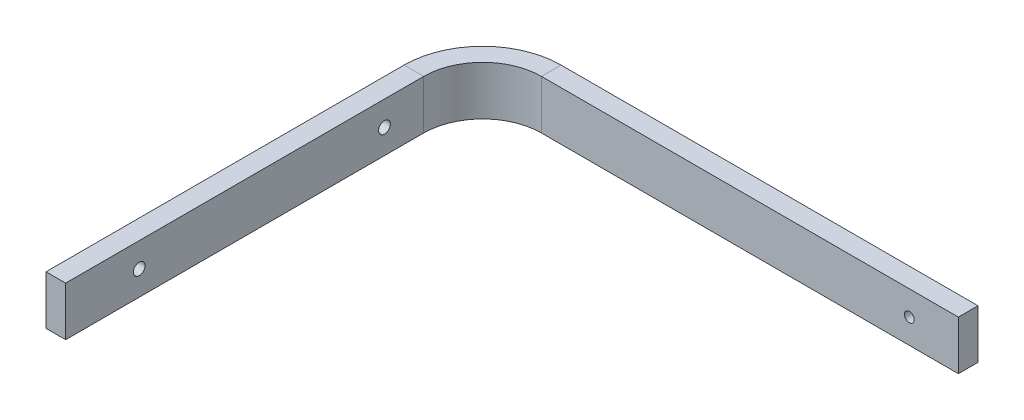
ISO-10303-21;
HEADER;
FILE_DESCRIPTION(('STEP AP214'),'2;1');
FILE_NAME('part.step','',(''),(''),'','','');
FILE_SCHEMA(('AUTOMOTIVE_DESIGN { 1 0 10303 214 1 1 1 1 }'));
ENDSEC;
DATA;
#1=APPLICATION_CONTEXT('core data for automotive mechanical design processes');
#2=APPLICATION_PROTOCOL_DEFINITION('international standard','automotive_design',2000,#1);
#3=PRODUCT_CONTEXT('',#1,'mechanical');
#4=PRODUCT('Part','Part','',(#3));
#5=PRODUCT_RELATED_PRODUCT_CATEGORY('part','',(#4));
#6=PRODUCT_DEFINITION_FORMATION('','',#4);
#7=PRODUCT_DEFINITION_CONTEXT('part definition',#1,'design');
#8=PRODUCT_DEFINITION('design','',#6,#7);
#9=PRODUCT_DEFINITION_SHAPE('','',#8);
#10=(LENGTH_UNIT() NAMED_UNIT(*) SI_UNIT(.MILLI.,.METRE.));
#11=(NAMED_UNIT(*) PLANE_ANGLE_UNIT() SI_UNIT($,.RADIAN.));
#12=(NAMED_UNIT(*) SI_UNIT($,.STERADIAN.) SOLID_ANGLE_UNIT());
#13=UNCERTAINTY_MEASURE_WITH_UNIT(LENGTH_MEASURE(1.E-05),#10,'distance_accuracy_value','');
#14=(GEOMETRIC_REPRESENTATION_CONTEXT(3) GLOBAL_UNCERTAINTY_ASSIGNED_CONTEXT((#13)) GLOBAL_UNIT_ASSIGNED_CONTEXT((#10,
#11,#12)) REPRESENTATION_CONTEXT('',''));
#15=CARTESIAN_POINT('',(0.,0.,0.));
#16=DIRECTION('',(0.,0.,1.));
#17=DIRECTION('',(1.,0.,0.));
#18=AXIS2_PLACEMENT_3D('',#15,#16,#17);
#19=CARTESIAN_POINT('',(-252.51106428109,-12.4999999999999,-227.488935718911));
#20=DIRECTION('',(-1.,0.,0.));
#21=DIRECTION('',(0.,0.,1.));
#22=AXIS2_PLACEMENT_3D('',#19,#20,#21);
#23=PLANE('',#22);
#24=CARTESIAN_POINT('',(-252.511064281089,0.,185.000000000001));
#25=DIRECTION('',(1.,0.,0.));
#26=DIRECTION('',(0.,0.,-1.));
#27=AXIS2_PLACEMENT_3D('',#24,#25,#26);
#28=CIRCLE('',#27,2.99999999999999);
#29=CARTESIAN_POINT('',(-252.511064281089,0.,182.000000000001));
#30=VERTEX_POINT('',#29);
#31=EDGE_CURVE('E189',#30,#30,#28,.T.);
#32=ORIENTED_EDGE('',*,*,#31,.T.);
#33=EDGE_LOOP('',(#32));
#34=FACE_BOUND('',#33,.T.);
#35=DIRECTION('',(0.,0.,1.));
#36=VECTOR('',#35,1.);
#37=CARTESIAN_POINT('',(-252.51106428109,12.4999999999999,-227.488935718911));
#38=LINE('',#37,#36);
#39=CARTESIAN_POINT('',(-252.511064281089,12.5,40.0000000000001));
#40=VERTEX_POINT('',#39);
#41=CARTESIAN_POINT('',(-252.511064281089,12.5,222.511064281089));
#42=VERTEX_POINT('',#41);
#43=EDGE_CURVE('E162',#40,#42,#38,.T.);
#44=ORIENTED_EDGE('',*,*,#43,.F.);
#45=DIRECTION('',(0.,-1.,0.));
#46=VECTOR('',#45,1.);
#47=CARTESIAN_POINT('',(-252.511064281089,-12.4999999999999,40.0000000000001));
#48=LINE('',#47,#46);
#49=CARTESIAN_POINT('',(-252.511064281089,-12.5,40.0000000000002));
#50=VERTEX_POINT('',#49);
#51=EDGE_CURVE('E11',#40,#50,#48,.T.);
#52=ORIENTED_EDGE('',*,*,#51,.T.);
#53=DIRECTION('',(0.,0.,-1.));
#54=VECTOR('',#53,1.);
#55=CARTESIAN_POINT('',(-252.51106428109,-12.4999999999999,-227.488935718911));
#56=LINE('',#55,#54);
#57=CARTESIAN_POINT('',(-252.511064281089,-12.5,222.511064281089));
#58=VERTEX_POINT('',#57);
#59=EDGE_CURVE('E161',#58,#50,#56,.T.);
#60=ORIENTED_EDGE('',*,*,#59,.F.);
#61=DIRECTION('',(0.,-1.,0.));
#62=VECTOR('',#61,1.);
#63=CARTESIAN_POINT('',(-252.511064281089,12.5,222.511064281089));
#64=LINE('',#63,#62);
#65=EDGE_CURVE('E159',#42,#58,#64,.T.);
#66=ORIENTED_EDGE('',*,*,#65,.F.);
#67=EDGE_LOOP('',(#44,#52,#60,#66));
#68=FACE_BOUND('',#67,.T.);
#69=CARTESIAN_POINT('',(-252.51106428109,0.,60.0000000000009));
#70=DIRECTION('',(1.,0.,0.));
#71=DIRECTION('',(0.,0.,-1.));
#72=AXIS2_PLACEMENT_3D('',#69,#70,#71);
#73=CIRCLE('',#72,3.00000000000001);
#74=CARTESIAN_POINT('',(-252.51106428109,0.,57.0000000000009));
#75=VERTEX_POINT('',#74);
#76=EDGE_CURVE('E195',#75,#75,#73,.T.);
#77=ORIENTED_EDGE('',*,*,#76,.T.);
#78=EDGE_LOOP('',(#77));
#79=FACE_BOUND('',#78,.T.);
#80=ADVANCED_FACE('F33',(#34,#68,#79),#23,.T.);
#81=CARTESIAN_POINT('',(-242.51106428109,-12.4999999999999,-227.488935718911));
#82=DIRECTION('',(-1.,0.,0.));
#83=DIRECTION('',(0.,0.,1.));
#84=AXIS2_PLACEMENT_3D('',#81,#82,#83);
#85=PLANE('',#84);
#86=CARTESIAN_POINT('',(-242.511064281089,0.,185.000000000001));
#87=DIRECTION('',(1.,0.,0.));
#88=DIRECTION('',(0.,0.,-1.));
#89=AXIS2_PLACEMENT_3D('',#86,#87,#88);
#90=CIRCLE('',#89,2.99999999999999);
#91=CARTESIAN_POINT('',(-242.511064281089,0.,182.000000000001));
#92=VERTEX_POINT('',#91);
#93=EDGE_CURVE('E185',#92,#92,#90,.T.);
#94=ORIENTED_EDGE('',*,*,#93,.F.);
#95=EDGE_LOOP('',(#94));
#96=FACE_BOUND('',#95,.T.);
#97=DIRECTION('',(0.,-1.,0.));
#98=VECTOR('',#97,1.);
#99=CARTESIAN_POINT('',(-242.511064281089,-12.4999999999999,40.0000000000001));
#100=LINE('',#99,#98);
#101=CARTESIAN_POINT('',(-242.511064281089,12.5,40.0000000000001));
#102=VERTEX_POINT('',#101);
#103=CARTESIAN_POINT('',(-242.511064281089,-12.5,40.0000000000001));
#104=VERTEX_POINT('',#103);
#105=EDGE_CURVE('E42',#102,#104,#100,.T.);
#106=ORIENTED_EDGE('',*,*,#105,.F.);
#107=DIRECTION('',(0.,0.,1.));
#108=VECTOR('',#107,1.);
#109=CARTESIAN_POINT('',(-242.51106428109,12.4999999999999,-227.488935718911));
#110=LINE('',#109,#108);
#111=CARTESIAN_POINT('',(-242.511064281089,12.5,222.511064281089));
#112=VERTEX_POINT('',#111);
#113=EDGE_CURVE('E37',#102,#112,#110,.T.);
#114=ORIENTED_EDGE('',*,*,#113,.T.);
#115=DIRECTION('',(0.,-1.,0.));
#116=VECTOR('',#115,1.);
#117=CARTESIAN_POINT('',(-242.511064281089,12.5,222.511064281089));
#118=LINE('',#117,#116);
#119=CARTESIAN_POINT('',(-242.511064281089,-12.5,222.511064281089));
#120=VERTEX_POINT('',#119);
#121=EDGE_CURVE('E156',#112,#120,#118,.T.);
#122=ORIENTED_EDGE('',*,*,#121,.T.);
#123=DIRECTION('',(0.,0.,-1.));
#124=VECTOR('',#123,1.);
#125=CARTESIAN_POINT('',(-242.51106428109,-12.4999999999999,-227.488935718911));
#126=LINE('',#125,#124);
#127=EDGE_CURVE('E158',#120,#104,#126,.T.);
#128=ORIENTED_EDGE('',*,*,#127,.T.);
#129=EDGE_LOOP('',(#106,#114,#122,#128));
#130=FACE_BOUND('',#129,.T.);
#131=CARTESIAN_POINT('',(-242.51106428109,0.,60.0000000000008));
#132=DIRECTION('',(1.,0.,0.));
#133=DIRECTION('',(0.,0.,-1.));
#134=AXIS2_PLACEMENT_3D('',#131,#132,#133);
#135=CIRCLE('',#134,3.00000000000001);
#136=CARTESIAN_POINT('',(-242.51106428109,0.,57.0000000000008));
#137=VERTEX_POINT('',#136);
#138=EDGE_CURVE('E192',#137,#137,#135,.T.);
#139=ORIENTED_EDGE('',*,*,#138,.F.);
#140=EDGE_LOOP('',(#139));
#141=FACE_BOUND('',#140,.T.);
#142=ADVANCED_FACE('F174',(#96,#130,#141),#85,.F.);
#143=CARTESIAN_POINT('',(-242.51106428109,12.4999999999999,-227.488935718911));
#144=DIRECTION('',(0.,-1.,0.));
#145=DIRECTION('',(0.,0.,-1.));
#146=AXIS2_PLACEMENT_3D('',#143,#144,#145);
#147=PLANE('',#146);
#148=DIRECTION('',(1.,0.,0.));
#149=VECTOR('',#148,1.);
#150=CARTESIAN_POINT('',(-242.511064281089,12.5,40.0000000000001));
#151=LINE('',#150,#149);
#152=EDGE_CURVE('E169',#40,#102,#151,.T.);
#153=ORIENTED_EDGE('',*,*,#152,.F.);
#154=ORIENTED_EDGE('',*,*,#43,.T.);
#155=DIRECTION('',(-1.,0.,0.));
#156=VECTOR('',#155,1.);
#157=CARTESIAN_POINT('',(-242.511064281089,12.5,222.511064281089));
#158=LINE('',#157,#156);
#159=EDGE_CURVE('E166',#112,#42,#158,.T.);
#160=ORIENTED_EDGE('',*,*,#159,.F.);
#161=ORIENTED_EDGE('',*,*,#113,.F.);
#162=EDGE_LOOP('',(#153,#154,#160,#161));
#163=FACE_BOUND('',#162,.T.);
#164=ADVANCED_FACE('F35',(#163),#147,.F.);
#165=CARTESIAN_POINT('',(-242.511064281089,12.5,222.511064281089));
#166=DIRECTION('',(0.,0.,-1.));
#167=DIRECTION('',(-1.,0.,0.));
#168=AXIS2_PLACEMENT_3D('',#165,#166,#167);
#169=PLANE('',#168);
#170=ORIENTED_EDGE('',*,*,#65,.T.);
#171=DIRECTION('',(-1.,0.,0.));
#172=VECTOR('',#171,1.);
#173=CARTESIAN_POINT('',(-242.511064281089,-12.5,222.511064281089));
#174=LINE('',#173,#172);
#175=EDGE_CURVE('E163',#120,#58,#174,.T.);
#176=ORIENTED_EDGE('',*,*,#175,.F.);
#177=ORIENTED_EDGE('',*,*,#121,.F.);
#178=ORIENTED_EDGE('',*,*,#159,.T.);
#179=EDGE_LOOP('',(#170,#176,#177,#178));
#180=FACE_BOUND('',#179,.T.);
#181=ADVANCED_FACE('F243',(#180),#169,.F.);
#182=CARTESIAN_POINT('',(-242.51106428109,-12.4999999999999,-227.488935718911));
#183=DIRECTION('',(0.,1.,0.));
#184=DIRECTION('',(0.,0.,1.));
#185=AXIS2_PLACEMENT_3D('',#182,#183,#184);
#186=PLANE('',#185);
#187=DIRECTION('',(-1.,0.,0.));
#188=VECTOR('',#187,1.);
#189=CARTESIAN_POINT('',(-242.511064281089,-12.5,40.0000000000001));
#190=LINE('',#189,#188);
#191=EDGE_CURVE('E50',#104,#50,#190,.T.);
#192=ORIENTED_EDGE('',*,*,#191,.F.);
#193=ORIENTED_EDGE('',*,*,#127,.F.);
#194=ORIENTED_EDGE('',*,*,#175,.T.);
#195=ORIENTED_EDGE('',*,*,#59,.T.);
#196=EDGE_LOOP('',(#192,#193,#194,#195));
#197=FACE_BOUND('',#196,.T.);
#198=ADVANCED_FACE('F241',(#197),#186,.F.);
#199=CARTESIAN_POINT('',(0.,12.4999999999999,10.));
#200=DIRECTION('',(-1.,0.,0.));
#201=DIRECTION('',(0.,0.,1.));
#202=AXIS2_PLACEMENT_3D('',#199,#200,#201);
#203=PLANE('',#202);
#204=DIRECTION('',(0.,1.,0.));
#205=VECTOR('',#204,1.);
#206=CARTESIAN_POINT('',(0.,12.4999999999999,0.));
#207=LINE('',#206,#205);
#208=CARTESIAN_POINT('',(0.,-12.4999999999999,0.));
#209=VERTEX_POINT('',#208);
#210=CARTESIAN_POINT('',(0.,12.4999999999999,0.));
#211=VERTEX_POINT('',#210);
#212=EDGE_CURVE('E131',#209,#211,#207,.T.);
#213=ORIENTED_EDGE('',*,*,#212,.T.);
#214=DIRECTION('',(0.,0.,-1.));
#215=VECTOR('',#214,1.);
#216=CARTESIAN_POINT('',(0.,12.4999999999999,10.));
#217=LINE('',#216,#215);
#218=CARTESIAN_POINT('',(0.,12.4999999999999,10.));
#219=VERTEX_POINT('',#218);
#220=EDGE_CURVE('E111',#219,#211,#217,.T.);
#221=ORIENTED_EDGE('',*,*,#220,.F.);
#222=DIRECTION('',(0.,1.,0.));
#223=VECTOR('',#222,1.);
#224=CARTESIAN_POINT('',(0.,12.4999999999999,10.));
#225=LINE('',#224,#223);
#226=CARTESIAN_POINT('',(0.,-12.4999999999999,10.));
#227=VERTEX_POINT('',#226);
#228=EDGE_CURVE('E142',#227,#219,#225,.T.);
#229=ORIENTED_EDGE('',*,*,#228,.F.);
#230=DIRECTION('',(0.,0.,-1.));
#231=VECTOR('',#230,1.);
#232=CARTESIAN_POINT('',(0.,-12.4999999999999,10.));
#233=LINE('',#232,#231);
#234=EDGE_CURVE('E152',#227,#209,#233,.T.);
#235=ORIENTED_EDGE('',*,*,#234,.T.);
#236=EDGE_LOOP('',(#213,#221,#229,#235));
#237=FACE_BOUND('',#236,.T.);
#238=ADVANCED_FACE('F219',(#237),#203,.F.);
#239=CARTESIAN_POINT('',(0.,-12.4999999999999,10.));
#240=DIRECTION('',(0.,0.,-1.));
#241=DIRECTION('',(-1.,0.,0.));
#242=AXIS2_PLACEMENT_3D('',#239,#240,#241);
#243=PLANE('',#242);
#244=CARTESIAN_POINT('',(-25.,0.,10.));
#245=DIRECTION('',(0.,0.,1.));
#246=DIRECTION('',(1.,0.,0.));
#247=AXIS2_PLACEMENT_3D('',#244,#245,#246);
#248=CIRCLE('',#247,2.5);
#249=CARTESIAN_POINT('',(-22.5,0.,10.));
#250=VERTEX_POINT('',#249);
#251=EDGE_CURVE('E201',#250,#250,#248,.T.);
#252=ORIENTED_EDGE('',*,*,#251,.F.);
#253=EDGE_LOOP('',(#252));
#254=FACE_BOUND('',#253,.T.);
#255=DIRECTION('',(-1.,0.,0.));
#256=VECTOR('',#255,1.);
#257=CARTESIAN_POINT('',(0.,12.4999999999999,10.));
#258=LINE('',#257,#256);
#259=CARTESIAN_POINT('',(-212.511064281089,12.5,9.99999999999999));
#260=VERTEX_POINT('',#259);
#261=EDGE_CURVE('E150',#219,#260,#258,.T.);
#262=ORIENTED_EDGE('',*,*,#261,.T.);
#263=DIRECTION('',(0.,-1.,0.));
#264=VECTOR('',#263,1.);
#265=CARTESIAN_POINT('',(-212.511064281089,-12.4999999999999,10.));
#266=LINE('',#265,#264);
#267=CARTESIAN_POINT('',(-212.511064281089,-12.5,9.99999999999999));
#268=VERTEX_POINT('',#267);
#269=EDGE_CURVE('E147',#260,#268,#266,.T.);
#270=ORIENTED_EDGE('',*,*,#269,.T.);
#271=DIRECTION('',(1.,0.,0.));
#272=VECTOR('',#271,1.);
#273=CARTESIAN_POINT('',(0.,-12.4999999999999,10.));
#274=LINE('',#273,#272);
#275=EDGE_CURVE('E145',#268,#227,#274,.T.);
#276=ORIENTED_EDGE('',*,*,#275,.T.);
#277=ORIENTED_EDGE('',*,*,#228,.T.);
#278=EDGE_LOOP('',(#262,#270,#276,#277));
#279=FACE_BOUND('',#278,.T.);
#280=ADVANCED_FACE('F215',(#254,#279),#243,.F.);
#281=CARTESIAN_POINT('',(0.,-12.4999999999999,10.));
#282=DIRECTION('',(0.,1.,0.));
#283=DIRECTION('',(-1.,0.,0.));
#284=AXIS2_PLACEMENT_3D('',#281,#282,#283);
#285=PLANE('',#284);
#286=ORIENTED_EDGE('',*,*,#275,.F.);
#287=DIRECTION('',(0.,0.,-1.));
#288=VECTOR('',#287,1.);
#289=CARTESIAN_POINT('',(-212.511064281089,-12.5,10.));
#290=LINE('',#289,#288);
#291=CARTESIAN_POINT('',(-212.511064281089,-12.5,0.));
#292=VERTEX_POINT('',#291);
#293=EDGE_CURVE('E137',#268,#292,#290,.T.);
#294=ORIENTED_EDGE('',*,*,#293,.T.);
#295=DIRECTION('',(1.,0.,0.));
#296=VECTOR('',#295,1.);
#297=CARTESIAN_POINT('',(0.,-12.4999999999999,0.));
#298=LINE('',#297,#296);
#299=EDGE_CURVE('E130',#292,#209,#298,.T.);
#300=ORIENTED_EDGE('',*,*,#299,.T.);
#301=ORIENTED_EDGE('',*,*,#234,.F.);
#302=EDGE_LOOP('',(#286,#294,#300,#301));
#303=FACE_BOUND('',#302,.T.);
#304=ADVANCED_FACE('F218',(#303),#285,.F.);
#305=CARTESIAN_POINT('',(0.,-12.4999999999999,0.));
#306=DIRECTION('',(0.,0.,-1.));
#307=DIRECTION('',(-1.,0.,0.));
#308=AXIS2_PLACEMENT_3D('',#305,#306,#307);
#309=PLANE('',#308);
#310=CARTESIAN_POINT('',(-25.,0.,0.));
#311=DIRECTION('',(0.,0.,1.));
#312=DIRECTION('',(1.,0.,0.));
#313=AXIS2_PLACEMENT_3D('',#310,#311,#312);
#314=CIRCLE('',#313,2.5);
#315=CARTESIAN_POINT('',(-22.5,0.,0.));
#316=VERTEX_POINT('',#315);
#317=EDGE_CURVE('E198',#316,#316,#314,.T.);
#318=ORIENTED_EDGE('',*,*,#317,.T.);
#319=EDGE_LOOP('',(#318));
#320=FACE_BOUND('',#319,.T.);
#321=DIRECTION('',(0.,-1.,0.));
#322=VECTOR('',#321,1.);
#323=CARTESIAN_POINT('',(-212.511064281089,-12.4999999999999,0.));
#324=LINE('',#323,#322);
#325=CARTESIAN_POINT('',(-212.511064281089,12.5,0.));
#326=VERTEX_POINT('',#325);
#327=EDGE_CURVE('E120',#326,#292,#324,.T.);
#328=ORIENTED_EDGE('',*,*,#327,.F.);
#329=DIRECTION('',(-1.,0.,0.));
#330=VECTOR('',#329,1.);
#331=CARTESIAN_POINT('',(0.,12.4999999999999,0.));
#332=LINE('',#331,#330);
#333=EDGE_CURVE('E112',#211,#326,#332,.T.);
#334=ORIENTED_EDGE('',*,*,#333,.F.);
#335=ORIENTED_EDGE('',*,*,#212,.F.);
#336=ORIENTED_EDGE('',*,*,#299,.F.);
#337=EDGE_LOOP('',(#328,#334,#335,#336));
#338=FACE_BOUND('',#337,.T.);
#339=ADVANCED_FACE('F127',(#320,#338),#309,.T.);
#340=CARTESIAN_POINT('',(0.,12.4999999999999,10.));
#341=DIRECTION('',(0.,-1.,0.));
#342=DIRECTION('',(1.,0.,0.));
#343=AXIS2_PLACEMENT_3D('',#340,#341,#342);
#344=PLANE('',#343);
#345=ORIENTED_EDGE('',*,*,#333,.T.);
#346=DIRECTION('',(0.,0.,1.));
#347=VECTOR('',#346,1.);
#348=CARTESIAN_POINT('',(-212.511064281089,12.5,10.));
#349=LINE('',#348,#347);
#350=EDGE_CURVE('E101',#326,#260,#349,.T.);
#351=ORIENTED_EDGE('',*,*,#350,.T.);
#352=ORIENTED_EDGE('',*,*,#261,.F.);
#353=ORIENTED_EDGE('',*,*,#220,.T.);
#354=EDGE_LOOP('',(#345,#351,#352,#353));
#355=FACE_BOUND('',#354,.T.);
#356=ADVANCED_FACE('F133',(#355),#344,.F.);
#357=CARTESIAN_POINT('',(-212.511064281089,12.5,40.));
#358=DIRECTION('',(0.,-1.,0.));
#359=DIRECTION('',(1.,0.,0.));
#360=AXIS2_PLACEMENT_3D('',#357,#358,#359);
#361=PLANE('',#360);
#362=ORIENTED_EDGE('',*,*,#152,.T.);
#363=CARTESIAN_POINT('',(-212.511064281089,12.5,40.));
#364=DIRECTION('',(0.,-1.,0.));
#365=DIRECTION('',(0.,0.,-1.));
#366=AXIS2_PLACEMENT_3D('',#363,#364,#365);
#367=CIRCLE('',#366,30.);
#368=EDGE_CURVE('E107',#260,#102,#367,.F.);
#369=ORIENTED_EDGE('',*,*,#368,.F.);
#370=ORIENTED_EDGE('',*,*,#350,.F.);
#371=CARTESIAN_POINT('',(-212.511064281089,12.5,40.));
#372=DIRECTION('',(0.,-1.,0.));
#373=DIRECTION('',(0.,0.,-1.));
#374=AXIS2_PLACEMENT_3D('',#371,#372,#373);
#375=CIRCLE('',#374,40.);
#376=EDGE_CURVE('E105',#326,#40,#375,.F.);
#377=ORIENTED_EDGE('',*,*,#376,.T.);
#378=EDGE_LOOP('',(#362,#369,#370,#377));
#379=FACE_BOUND('',#378,.T.);
#380=ADVANCED_FACE('F104',(#379),#361,.F.);
#381=CARTESIAN_POINT('',(-212.511064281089,-12.5,40.));
#382=DIRECTION('',(0.,1.,0.));
#383=DIRECTION('',(-1.,0.,0.));
#384=AXIS2_PLACEMENT_3D('',#381,#382,#383);
#385=PLANE('',#384);
#386=ORIENTED_EDGE('',*,*,#293,.F.);
#387=CARTESIAN_POINT('',(-212.511064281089,-12.5,40.));
#388=DIRECTION('',(0.,-1.,0.));
#389=DIRECTION('',(0.,0.,-1.));
#390=AXIS2_PLACEMENT_3D('',#387,#388,#389);
#391=CIRCLE('',#390,30.);
#392=EDGE_CURVE('E123',#104,#268,#391,.T.);
#393=ORIENTED_EDGE('',*,*,#392,.F.);
#394=ORIENTED_EDGE('',*,*,#191,.T.);
#395=CARTESIAN_POINT('',(-212.511064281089,-12.5,40.));
#396=DIRECTION('',(0.,-1.,0.));
#397=DIRECTION('',(0.,0.,-1.));
#398=AXIS2_PLACEMENT_3D('',#395,#396,#397);
#399=CIRCLE('',#398,40.);
#400=EDGE_CURVE('E122',#50,#292,#399,.T.);
#401=ORIENTED_EDGE('',*,*,#400,.T.);
#402=EDGE_LOOP('',(#386,#393,#394,#401));
#403=FACE_BOUND('',#402,.T.);
#404=ADVANCED_FACE('F183',(#403),#385,.F.);
#405=CARTESIAN_POINT('',(-212.511064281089,463.304835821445,40.));
#406=DIRECTION('',(0.,-1.,0.));
#407=DIRECTION('',(0.,0.,-1.));
#408=AXIS2_PLACEMENT_3D('',#405,#406,#407);
#409=CYLINDRICAL_SURFACE('',#408,40.);
#410=ORIENTED_EDGE('',*,*,#400,.F.);
#411=ORIENTED_EDGE('',*,*,#51,.F.);
#412=ORIENTED_EDGE('',*,*,#376,.F.);
#413=ORIENTED_EDGE('',*,*,#327,.T.);
#414=EDGE_LOOP('',(#410,#411,#412,#413));
#415=FACE_BOUND('',#414,.T.);
#416=ADVANCED_FACE('F119',(#415),#409,.T.);
#417=CARTESIAN_POINT('',(-212.511064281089,463.304835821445,40.));
#418=DIRECTION('',(0.,-1.,0.));
#419=DIRECTION('',(0.,0.,-1.));
#420=AXIS2_PLACEMENT_3D('',#417,#418,#419);
#421=CYLINDRICAL_SURFACE('',#420,30.);
#422=ORIENTED_EDGE('',*,*,#392,.T.);
#423=ORIENTED_EDGE('',*,*,#269,.F.);
#424=ORIENTED_EDGE('',*,*,#368,.T.);
#425=ORIENTED_EDGE('',*,*,#105,.T.);
#426=EDGE_LOOP('',(#422,#423,#424,#425));
#427=FACE_BOUND('',#426,.T.);
#428=ADVANCED_FACE('F181',(#427),#421,.F.);
#429=CARTESIAN_POINT('',(-252.511064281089,0.,185.000000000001));
#430=DIRECTION('',(1.,0.,0.));
#431=DIRECTION('',(0.,0.,-1.));
#432=AXIS2_PLACEMENT_3D('',#429,#430,#431);
#433=CYLINDRICAL_SURFACE('',#432,2.99999999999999);
#434=ORIENTED_EDGE('',*,*,#93,.T.);
#435=EDGE_LOOP('',(#434));
#436=FACE_BOUND('',#435,.T.);
#437=ORIENTED_EDGE('',*,*,#31,.F.);
#438=EDGE_LOOP('',(#437));
#439=FACE_BOUND('',#438,.T.);
#440=ADVANCED_FACE('F295',(#436,#439),#433,.F.);
#441=CARTESIAN_POINT('',(-252.51106428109,0.,60.0000000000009));
#442=DIRECTION('',(1.,0.,0.));
#443=DIRECTION('',(0.,0.,-1.));
#444=AXIS2_PLACEMENT_3D('',#441,#442,#443);
#445=CYLINDRICAL_SURFACE('',#444,3.00000000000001);
#446=ORIENTED_EDGE('',*,*,#138,.T.);
#447=EDGE_LOOP('',(#446));
#448=FACE_BOUND('',#447,.T.);
#449=ORIENTED_EDGE('',*,*,#76,.F.);
#450=EDGE_LOOP('',(#449));
#451=FACE_BOUND('',#450,.T.);
#452=ADVANCED_FACE('F211',(#448,#451),#445,.F.);
#453=CARTESIAN_POINT('',(-25.,0.,0.));
#454=DIRECTION('',(0.,0.,1.));
#455=DIRECTION('',(1.,0.,0.));
#456=AXIS2_PLACEMENT_3D('',#453,#454,#455);
#457=CYLINDRICAL_SURFACE('',#456,2.5);
#458=ORIENTED_EDGE('',*,*,#317,.F.);
#459=EDGE_LOOP('',(#458));
#460=FACE_BOUND('',#459,.T.);
#461=ORIENTED_EDGE('',*,*,#251,.T.);
#462=EDGE_LOOP('',(#461));
#463=FACE_BOUND('',#462,.T.);
#464=ADVANCED_FACE('F208',(#460,#463),#457,.F.);
#465=CLOSED_SHELL('',(#80,#142,#164,#181,#198,#238,#280,#304,#339,#356,#380,#404,#416,#428,#440,
#452,#464));
#466=MANIFOLD_SOLID_BREP('B2',#465);
#467=ADVANCED_BREP_SHAPE_REPRESENTATION('',(#18,#466),#14);
#468=SHAPE_DEFINITION_REPRESENTATION(#9,#467);
ENDSEC;
END-ISO-10303-21;
